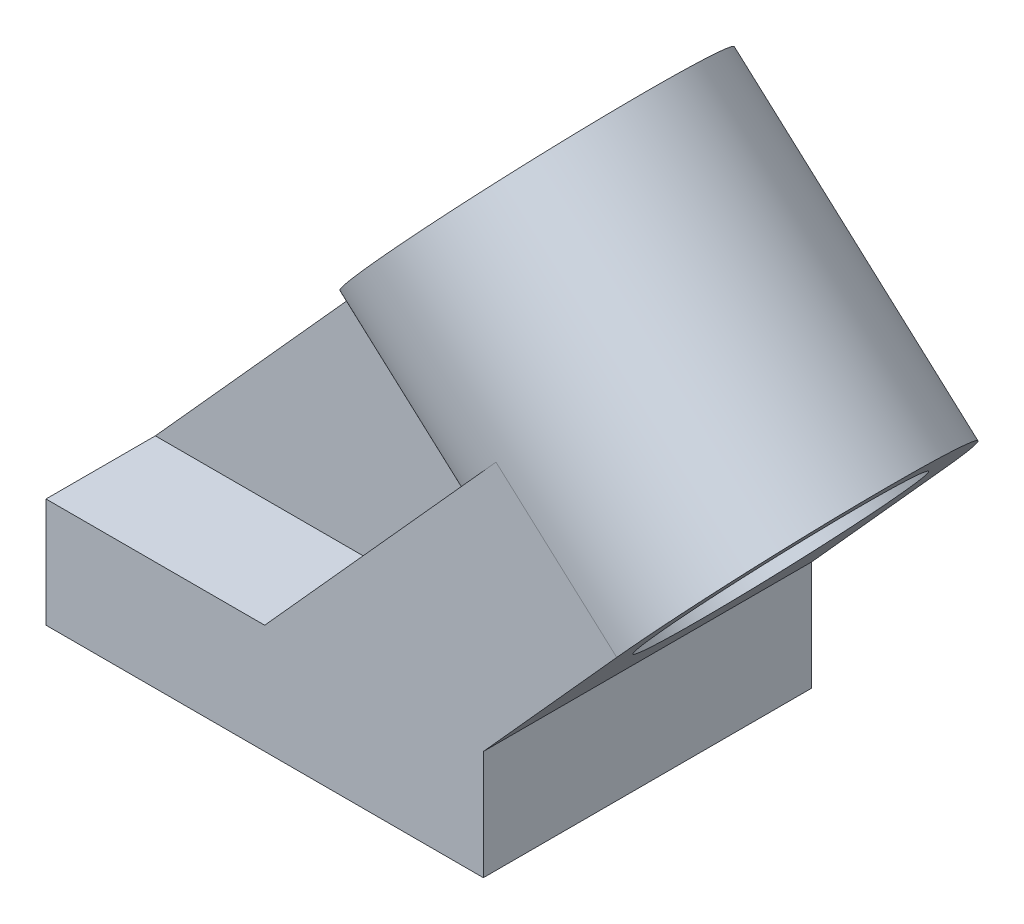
ISO-10303-21;
HEADER;
FILE_DESCRIPTION(('STEP AP214'),'2;1');
FILE_NAME('part.step','',(''),(''),'','','');
FILE_SCHEMA(('AUTOMOTIVE_DESIGN { 1 0 10303 214 1 1 1 1 }'));
ENDSEC;
DATA;
#1=APPLICATION_CONTEXT('core data for automotive mechanical design processes');
#2=APPLICATION_PROTOCOL_DEFINITION('international standard','automotive_design',2000,#1);
#3=PRODUCT_CONTEXT('',#1,'mechanical');
#4=PRODUCT('Part','Part','',(#3));
#5=PRODUCT_RELATED_PRODUCT_CATEGORY('part','',(#4));
#6=PRODUCT_DEFINITION_FORMATION('','',#4);
#7=PRODUCT_DEFINITION_CONTEXT('part definition',#1,'design');
#8=PRODUCT_DEFINITION('design','',#6,#7);
#9=PRODUCT_DEFINITION_SHAPE('','',#8);
#10=(LENGTH_UNIT() NAMED_UNIT(*) SI_UNIT(.MILLI.,.METRE.));
#11=(NAMED_UNIT(*) PLANE_ANGLE_UNIT() SI_UNIT($,.RADIAN.));
#12=(NAMED_UNIT(*) SI_UNIT($,.STERADIAN.) SOLID_ANGLE_UNIT());
#13=UNCERTAINTY_MEASURE_WITH_UNIT(LENGTH_MEASURE(1.E-05),#10,'distance_accuracy_value','');
#14=(GEOMETRIC_REPRESENTATION_CONTEXT(3) GLOBAL_UNCERTAINTY_ASSIGNED_CONTEXT((#13)) GLOBAL_UNIT_ASSIGNED_CONTEXT((#10,
#11,#12)) REPRESENTATION_CONTEXT('',''));
#15=CARTESIAN_POINT('',(0.,0.,0.));
#16=DIRECTION('',(0.,0.,1.));
#17=DIRECTION('',(1.,0.,0.));
#18=AXIS2_PLACEMENT_3D('',#15,#16,#17);
#19=CARTESIAN_POINT('',(104.536651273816,85.0805974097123,76.2));
#20=DIRECTION('',(0.743144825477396,-0.669130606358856,0.));
#21=DIRECTION('',(0.669130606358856,0.743144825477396,0.));
#22=AXIS2_PLACEMENT_3D('',#19,#20,#21);
#23=PLANE('',#22);
#24=DIRECTION('',(-0.669130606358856,-0.743144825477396,0.));
#25=VECTOR('',#24,1.);
#26=CARTESIAN_POINT('',(104.536651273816,85.0805974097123,25.4));
#27=LINE('',#26,#25);
#28=CARTESIAN_POINT('',(80.5007943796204,58.3860739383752,25.4));
#29=VERTEX_POINT('',#28);
#30=CARTESIAN_POINT('',(50.8,25.4,25.4));
#31=VERTEX_POINT('',#30);
#32=EDGE_CURVE('E213',#29,#31,#27,.T.);
#33=ORIENTED_EDGE('',*,*,#32,.F.);
#34=CARTESIAN_POINT('',(104.536651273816,85.0805974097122,38.1));
#35=DIRECTION('',(0.743144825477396,-0.669130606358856,0.));
#36=DIRECTION('',(0.669130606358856,0.743144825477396,0.));
#37=AXIS2_PLACEMENT_3D('',#34,#35,#36);
#38=CIRCLE('',#37,38.1);
#39=CARTESIAN_POINT('',(104.536651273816,85.0805974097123,0.));
#40=VERTEX_POINT('',#39);
#41=EDGE_CURVE('E136',#29,#40,#38,.T.);
#42=ORIENTED_EDGE('',*,*,#41,.T.);
#43=DIRECTION('',(-0.669130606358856,-0.743144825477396,0.));
#44=VECTOR('',#43,1.);
#45=CARTESIAN_POINT('',(104.536651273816,85.0805974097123,0.));
#46=LINE('',#45,#44);
#47=CARTESIAN_POINT('',(50.8,25.4,0.));
#48=VERTEX_POINT('',#47);
#49=EDGE_CURVE('E164',#40,#48,#46,.T.);
#50=ORIENTED_EDGE('',*,*,#49,.T.);
#51=DIRECTION('',(0.,0.,-1.));
#52=VECTOR('',#51,1.);
#53=CARTESIAN_POINT('',(50.8,25.4,76.2));
#54=LINE('',#53,#52);
#55=EDGE_CURVE('E171',#31,#48,#54,.T.);
#56=ORIENTED_EDGE('',*,*,#55,.F.);
#57=EDGE_LOOP('',(#33,#42,#50,#56));
#58=FACE_BOUND('',#57,.T.);
#59=ADVANCED_FACE('F37',(#58),#23,.F.);
#60=CARTESIAN_POINT('',(50.8,25.4,76.2));
#61=DIRECTION('',(0.,-1.,0.));
#62=DIRECTION('',(1.,0.,0.));
#63=AXIS2_PLACEMENT_3D('',#60,#61,#62);
#64=PLANE('',#63);
#65=DIRECTION('',(-1.,0.,0.));
#66=VECTOR('',#65,1.);
#67=CARTESIAN_POINT('',(50.8,25.4,25.4));
#68=LINE('',#67,#66);
#69=CARTESIAN_POINT('',(0.,25.4,25.4));
#70=VERTEX_POINT('',#69);
#71=EDGE_CURVE('E216',#31,#70,#68,.T.);
#72=ORIENTED_EDGE('',*,*,#71,.F.);
#73=ORIENTED_EDGE('',*,*,#55,.T.);
#74=DIRECTION('',(-1.,0.,0.));
#75=VECTOR('',#74,1.);
#76=CARTESIAN_POINT('',(50.8,25.4,0.));
#77=LINE('',#76,#75);
#78=CARTESIAN_POINT('',(0.,25.4,0.));
#79=VERTEX_POINT('',#78);
#80=EDGE_CURVE('E148',#48,#79,#77,.T.);
#81=ORIENTED_EDGE('',*,*,#80,.T.);
#82=DIRECTION('',(0.,0.,-1.));
#83=VECTOR('',#82,1.);
#84=CARTESIAN_POINT('',(0.,25.4,76.2));
#85=LINE('',#84,#83);
#86=EDGE_CURVE('E88',#70,#79,#85,.T.);
#87=ORIENTED_EDGE('',*,*,#86,.F.);
#88=EDGE_LOOP('',(#72,#73,#81,#87));
#89=FACE_BOUND('',#88,.T.);
#90=ADVANCED_FACE('F244',(#89),#64,.F.);
#91=CARTESIAN_POINT('',(0.,25.4,76.2));
#92=DIRECTION('',(1.,0.,0.));
#93=DIRECTION('',(0.,0.,-1.));
#94=AXIS2_PLACEMENT_3D('',#91,#92,#93);
#95=PLANE('',#94);
#96=CARTESIAN_POINT('',(0.,25.4,76.2));
#97=VERTEX_POINT('',#96);
#98=CARTESIAN_POINT('',(0.,25.4,50.8));
#99=VERTEX_POINT('',#98);
#100=EDGE_CURVE('E168',#97,#99,#85,.T.);
#101=ORIENTED_EDGE('',*,*,#100,.T.);
#102=DIRECTION('',(0.,0.,1.));
#103=VECTOR('',#102,1.);
#104=CARTESIAN_POINT('',(0.,25.4,76.2));
#105=LINE('',#104,#103);
#106=EDGE_CURVE('E198',#99,#70,#105,.F.);
#107=ORIENTED_EDGE('',*,*,#106,.T.);
#108=ORIENTED_EDGE('',*,*,#86,.T.);
#109=DIRECTION('',(0.,-1.,0.));
#110=VECTOR('',#109,1.);
#111=CARTESIAN_POINT('',(0.,25.4,0.));
#112=LINE('',#111,#110);
#113=CARTESIAN_POINT('',(0.,0.,0.));
#114=VERTEX_POINT('',#113);
#115=EDGE_CURVE('E135',#79,#114,#112,.T.);
#116=ORIENTED_EDGE('',*,*,#115,.T.);
#117=DIRECTION('',(0.,0.,-1.));
#118=VECTOR('',#117,1.);
#119=CARTESIAN_POINT('',(0.,0.,76.2));
#120=LINE('',#119,#118);
#121=CARTESIAN_POINT('',(0.,0.,76.2));
#122=VERTEX_POINT('',#121);
#123=EDGE_CURVE('E11',#122,#114,#120,.T.);
#124=ORIENTED_EDGE('',*,*,#123,.F.);
#125=DIRECTION('',(0.,-1.,0.));
#126=VECTOR('',#125,1.);
#127=CARTESIAN_POINT('',(0.,25.4,76.2));
#128=LINE('',#127,#126);
#129=EDGE_CURVE('E146',#97,#122,#128,.T.);
#130=ORIENTED_EDGE('',*,*,#129,.F.);
#131=EDGE_LOOP('',(#101,#107,#108,#116,#124,#130));
#132=FACE_BOUND('',#131,.T.);
#133=ADVANCED_FACE('F39',(#132),#95,.F.);
#134=CARTESIAN_POINT('',(0.,0.,76.2));
#135=DIRECTION('',(0.,1.,0.));
#136=DIRECTION('',(0.,0.,1.));
#137=AXIS2_PLACEMENT_3D('',#134,#135,#136);
#138=PLANE('',#137);
#139=ORIENTED_EDGE('',*,*,#123,.T.);
#140=DIRECTION('',(1.,0.,0.));
#141=VECTOR('',#140,1.);
#142=CARTESIAN_POINT('',(0.,0.,0.));
#143=LINE('',#142,#141);
#144=CARTESIAN_POINT('',(101.6,0.,0.));
#145=VERTEX_POINT('',#144);
#146=EDGE_CURVE('E138',#114,#145,#143,.T.);
#147=ORIENTED_EDGE('',*,*,#146,.T.);
#148=DIRECTION('',(0.,0.,-1.));
#149=VECTOR('',#148,1.);
#150=CARTESIAN_POINT('',(101.6,0.,76.2));
#151=LINE('',#150,#149);
#152=CARTESIAN_POINT('',(101.6,0.,76.2));
#153=VERTEX_POINT('',#152);
#154=EDGE_CURVE('E45',#153,#145,#151,.T.);
#155=ORIENTED_EDGE('',*,*,#154,.F.);
#156=DIRECTION('',(1.,0.,0.));
#157=VECTOR('',#156,1.);
#158=CARTESIAN_POINT('',(0.,0.,76.2));
#159=LINE('',#158,#157);
#160=EDGE_CURVE('E96',#122,#153,#159,.T.);
#161=ORIENTED_EDGE('',*,*,#160,.F.);
#162=EDGE_LOOP('',(#139,#147,#155,#161));
#163=FACE_BOUND('',#162,.T.);
#164=ADVANCED_FACE('F181',(#163),#138,.F.);
#165=CARTESIAN_POINT('',(101.6,0.,76.2));
#166=DIRECTION('',(-1.,0.,0.));
#167=DIRECTION('',(0.,0.,1.));
#168=AXIS2_PLACEMENT_3D('',#165,#166,#167);
#169=PLANE('',#168);
#170=ORIENTED_EDGE('',*,*,#154,.T.);
#171=DIRECTION('',(0.,1.,0.));
#172=VECTOR('',#171,1.);
#173=CARTESIAN_POINT('',(101.6,0.,0.));
#174=LINE('',#173,#172);
#175=CARTESIAN_POINT('',(101.6,25.4,0.));
#176=VERTEX_POINT('',#175);
#177=EDGE_CURVE('E156',#145,#176,#174,.T.);
#178=ORIENTED_EDGE('',*,*,#177,.T.);
#179=DIRECTION('',(0.,0.,-1.));
#180=VECTOR('',#179,1.);
#181=CARTESIAN_POINT('',(101.6,25.4,76.2));
#182=LINE('',#181,#180);
#183=CARTESIAN_POINT('',(101.6,25.4,76.2));
#184=VERTEX_POINT('',#183);
#185=EDGE_CURVE('E173',#184,#176,#182,.T.);
#186=ORIENTED_EDGE('',*,*,#185,.F.);
#187=DIRECTION('',(0.,1.,0.));
#188=VECTOR('',#187,1.);
#189=CARTESIAN_POINT('',(101.6,0.,76.2));
#190=LINE('',#189,#188);
#191=EDGE_CURVE('E150',#153,#184,#190,.T.);
#192=ORIENTED_EDGE('',*,*,#191,.F.);
#193=EDGE_LOOP('',(#170,#178,#186,#192));
#194=FACE_BOUND('',#193,.T.);
#195=ADVANCED_FACE('F176',(#194),#169,.F.);
#196=CARTESIAN_POINT('',(101.6,25.4,76.2));
#197=DIRECTION('',(-0.743144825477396,0.669130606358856,0.));
#198=DIRECTION('',(-0.669130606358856,-0.743144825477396,0.));
#199=AXIS2_PLACEMENT_3D('',#196,#197,#198);
#200=PLANE('',#199);
#201=CARTESIAN_POINT('',(132.591674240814,59.8197412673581,38.1));
#202=DIRECTION('',(-0.743144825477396,0.669130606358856,0.));
#203=DIRECTION('',(-0.669130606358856,-0.743144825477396,0.));
#204=AXIS2_PLACEMENT_3D('',#201,#202,#203);
#205=CIRCLE('',#204,28.575);
#206=CARTESIAN_POINT('',(113.47126716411,38.5843778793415,38.1));
#207=VERTEX_POINT('',#206);
#208=EDGE_CURVE('E190',#207,#207,#205,.T.);
#209=ORIENTED_EDGE('',*,*,#208,.T.);
#210=EDGE_LOOP('',(#209));
#211=FACE_BOUND('',#210,.T.);
#212=ORIENTED_EDGE('',*,*,#185,.T.);
#213=DIRECTION('',(0.669130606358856,0.743144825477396,0.));
#214=VECTOR('',#213,1.);
#215=CARTESIAN_POINT('',(101.6,25.4,0.));
#216=LINE('',#215,#214);
#217=CARTESIAN_POINT('',(132.591674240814,59.8197412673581,0.));
#218=VERTEX_POINT('',#217);
#219=EDGE_CURVE('E159',#176,#218,#216,.T.);
#220=ORIENTED_EDGE('',*,*,#219,.T.);
#221=CARTESIAN_POINT('',(132.591674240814,59.8197412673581,38.1));
#222=DIRECTION('',(0.743144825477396,-0.669130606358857,0.));
#223=DIRECTION('',(0.669130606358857,0.743144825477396,0.));
#224=AXIS2_PLACEMENT_3D('',#221,#222,#223);
#225=CIRCLE('',#224,38.1);
#226=CARTESIAN_POINT('',(132.591674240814,59.8197412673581,76.2));
#227=VERTEX_POINT('',#226);
#228=EDGE_CURVE('E144',#218,#227,#225,.T.);
#229=ORIENTED_EDGE('',*,*,#228,.T.);
#230=DIRECTION('',(0.669130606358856,0.743144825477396,0.));
#231=VECTOR('',#230,1.);
#232=CARTESIAN_POINT('',(101.6,25.4,76.2));
#233=LINE('',#232,#231);
#234=EDGE_CURVE('E115',#184,#227,#233,.T.);
#235=ORIENTED_EDGE('',*,*,#234,.F.);
#236=EDGE_LOOP('',(#212,#220,#229,#235));
#237=FACE_BOUND('',#236,.T.);
#238=ADVANCED_FACE('F189',(#211,#237),#200,.F.);
#239=CARTESIAN_POINT('',(104.536651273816,85.0805974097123,76.2));
#240=VERTEX_POINT('',#239);
#241=CARTESIAN_POINT('',(80.5007943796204,58.3860739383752,50.8));
#242=VERTEX_POINT('',#241);
#243=EDGE_CURVE('E125',#240,#242,#38,.T.);
#244=ORIENTED_EDGE('',*,*,#243,.T.);
#245=DIRECTION('',(-0.669130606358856,-0.743144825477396,0.));
#246=VECTOR('',#245,1.);
#247=CARTESIAN_POINT('',(104.536651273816,85.0805974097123,50.8));
#248=LINE('',#247,#246);
#249=CARTESIAN_POINT('',(50.8,25.4,50.8));
#250=VERTEX_POINT('',#249);
#251=EDGE_CURVE('E205',#242,#250,#248,.T.);
#252=ORIENTED_EDGE('',*,*,#251,.T.);
#253=CARTESIAN_POINT('',(50.8,25.4,76.2));
#254=VERTEX_POINT('',#253);
#255=EDGE_CURVE('E127',#254,#250,#54,.T.);
#256=ORIENTED_EDGE('',*,*,#255,.F.);
#257=DIRECTION('',(-0.669130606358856,-0.743144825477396,0.));
#258=VECTOR('',#257,1.);
#259=CARTESIAN_POINT('',(104.536651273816,85.0805974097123,76.2));
#260=LINE('',#259,#258);
#261=EDGE_CURVE('E112',#240,#254,#260,.T.);
#262=ORIENTED_EDGE('',*,*,#261,.F.);
#263=EDGE_LOOP('',(#244,#252,#256,#262));
#264=FACE_BOUND('',#263,.T.);
#265=ADVANCED_FACE('F122',(#264),#23,.F.);
#266=ORIENTED_EDGE('',*,*,#255,.T.);
#267=DIRECTION('',(-1.,0.,0.));
#268=VECTOR('',#267,1.);
#269=CARTESIAN_POINT('',(50.8,25.4,50.8));
#270=LINE('',#269,#268);
#271=EDGE_CURVE('E207',#250,#99,#270,.T.);
#272=ORIENTED_EDGE('',*,*,#271,.T.);
#273=ORIENTED_EDGE('',*,*,#100,.F.);
#274=DIRECTION('',(-1.,0.,0.));
#275=VECTOR('',#274,1.);
#276=CARTESIAN_POINT('',(50.8,25.4,76.2));
#277=LINE('',#276,#275);
#278=EDGE_CURVE('E61',#254,#97,#277,.T.);
#279=ORIENTED_EDGE('',*,*,#278,.F.);
#280=EDGE_LOOP('',(#266,#272,#273,#279));
#281=FACE_BOUND('',#280,.T.);
#282=ADVANCED_FACE('F251',(#281),#64,.F.);
#283=CARTESIAN_POINT('',(0.,0.,76.2));
#284=DIRECTION('',(0.,0.,1.));
#285=DIRECTION('',(1.,0.,0.));
#286=AXIS2_PLACEMENT_3D('',#283,#284,#285);
#287=PLANE('',#286);
#288=ORIENTED_EDGE('',*,*,#129,.T.);
#289=ORIENTED_EDGE('',*,*,#160,.T.);
#290=ORIENTED_EDGE('',*,*,#191,.T.);
#291=ORIENTED_EDGE('',*,*,#234,.T.);
#292=DIRECTION('',(-0.743144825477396,0.669130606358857,0.));
#293=VECTOR('',#292,1.);
#294=CARTESIAN_POINT('',(132.591674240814,59.8197412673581,76.2));
#295=LINE('',#294,#293);
#296=EDGE_CURVE('E109',#227,#240,#295,.T.);
#297=ORIENTED_EDGE('',*,*,#296,.T.);
#298=ORIENTED_EDGE('',*,*,#261,.T.);
#299=ORIENTED_EDGE('',*,*,#278,.T.);
#300=EDGE_LOOP('',(#288,#289,#290,#291,#297,#298,#299));
#301=FACE_BOUND('',#300,.T.);
#302=ADVANCED_FACE('F111',(#301),#287,.T.);
#303=CARTESIAN_POINT('',(0.,0.,0.));
#304=DIRECTION('',(0.,0.,1.));
#305=DIRECTION('',(1.,0.,0.));
#306=AXIS2_PLACEMENT_3D('',#303,#304,#305);
#307=PLANE('',#306);
#308=ORIENTED_EDGE('',*,*,#115,.F.);
#309=ORIENTED_EDGE('',*,*,#80,.F.);
#310=ORIENTED_EDGE('',*,*,#49,.F.);
#311=DIRECTION('',(-0.743144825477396,0.669130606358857,0.));
#312=VECTOR('',#311,1.);
#313=CARTESIAN_POINT('',(132.591674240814,59.8197412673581,0.));
#314=LINE('',#313,#312);
#315=EDGE_CURVE('E161',#218,#40,#314,.T.);
#316=ORIENTED_EDGE('',*,*,#315,.F.);
#317=ORIENTED_EDGE('',*,*,#219,.F.);
#318=ORIENTED_EDGE('',*,*,#177,.F.);
#319=ORIENTED_EDGE('',*,*,#146,.F.);
#320=EDGE_LOOP('',(#308,#309,#310,#316,#317,#318,#319));
#321=FACE_BOUND('',#320,.T.);
#322=ADVANCED_FACE('F185',(#321),#307,.F.);
#323=CARTESIAN_POINT('',(75.9640385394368,110.807493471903,38.1));
#324=DIRECTION('',(0.743144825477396,-0.669130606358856,0.));
#325=DIRECTION('',(0.669130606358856,0.743144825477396,0.));
#326=AXIS2_PLACEMENT_3D('',#323,#324,#325);
#327=CYLINDRICAL_SURFACE('',#326,38.1);
#328=ORIENTED_EDGE('',*,*,#296,.F.);
#329=ORIENTED_EDGE('',*,*,#228,.F.);
#330=ORIENTED_EDGE('',*,*,#315,.T.);
#331=ORIENTED_EDGE('',*,*,#41,.F.);
#332=DIRECTION('',(0.743144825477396,-0.669130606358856,0.));
#333=VECTOR('',#332,1.);
#334=CARTESIAN_POINT('',(51.9281816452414,84.1129700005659,25.4));
#335=LINE('',#334,#333);
#336=CARTESIAN_POINT('',(52.4457714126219,83.6469300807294,25.4));
#337=VERTEX_POINT('',#336);
#338=EDGE_CURVE('E210',#29,#337,#335,.F.);
#339=ORIENTED_EDGE('',*,*,#338,.T.);
#340=CARTESIAN_POINT('',(76.4816283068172,110.341453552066,38.1));
#341=DIRECTION('',(0.743144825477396,-0.669130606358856,0.));
#342=DIRECTION('',(0.669130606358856,0.743144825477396,0.));
#343=AXIS2_PLACEMENT_3D('',#340,#341,#342);
#344=CIRCLE('',#343,38.1);
#345=CARTESIAN_POINT('',(52.4457714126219,83.6469300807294,50.8));
#346=VERTEX_POINT('',#345);
#347=EDGE_CURVE('E202',#346,#337,#344,.T.);
#348=ORIENTED_EDGE('',*,*,#347,.F.);
#349=DIRECTION('',(0.743144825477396,-0.669130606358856,0.));
#350=VECTOR('',#349,1.);
#351=CARTESIAN_POINT('',(51.9281816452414,84.1129700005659,50.8));
#352=LINE('',#351,#350);
#353=EDGE_CURVE('E134',#242,#346,#352,.F.);
#354=ORIENTED_EDGE('',*,*,#353,.F.);
#355=ORIENTED_EDGE('',*,*,#243,.F.);
#356=EDGE_LOOP('',(#328,#329,#330,#331,#339,#348,#354,#355));
#357=FACE_BOUND('',#356,.T.);
#358=CARTESIAN_POINT('',(75.9640385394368,110.807493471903,38.1));
#359=DIRECTION('',(0.743144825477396,-0.669130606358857,0.));
#360=DIRECTION('',(0.669130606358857,0.743144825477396,0.));
#361=AXIS2_PLACEMENT_3D('',#358,#359,#360);
#362=CIRCLE('',#361,38.1);
#363=CARTESIAN_POINT('',(101.457914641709,139.121311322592,38.1));
#364=VERTEX_POINT('',#363);
#365=EDGE_CURVE('E141',#364,#364,#362,.T.);
#366=ORIENTED_EDGE('',*,*,#365,.T.);
#367=EDGE_LOOP('',(#366));
#368=FACE_BOUND('',#367,.T.);
#369=ADVANCED_FACE('F130',(#357,#368),#327,.T.);
#370=CARTESIAN_POINT('',(75.9640385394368,110.807493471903,38.1));
#371=DIRECTION('',(0.743144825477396,-0.669130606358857,0.));
#372=DIRECTION('',(0.669130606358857,0.743144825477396,0.));
#373=AXIS2_PLACEMENT_3D('',#370,#371,#372);
#374=PLANE('',#373);
#375=CARTESIAN_POINT('',(75.9640385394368,110.807493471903,38.1));
#376=DIRECTION('',(-0.743144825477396,0.669130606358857,0.));
#377=DIRECTION('',(-0.669130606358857,-0.743144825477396,0.));
#378=AXIS2_PLACEMENT_3D('',#375,#376,#377);
#379=CIRCLE('',#378,28.575);
#380=CARTESIAN_POINT('',(56.8436314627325,89.5721300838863,38.1));
#381=VERTEX_POINT('',#380);
#382=EDGE_CURVE('E193',#381,#381,#379,.T.);
#383=ORIENTED_EDGE('',*,*,#382,.F.);
#384=EDGE_LOOP('',(#383));
#385=FACE_BOUND('',#384,.T.);
#386=ORIENTED_EDGE('',*,*,#365,.F.);
#387=EDGE_LOOP('',(#386));
#388=FACE_BOUND('',#387,.T.);
#389=ADVANCED_FACE('F300',(#385,#388),#374,.F.);
#390=CARTESIAN_POINT('',(176.41705137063,20.359194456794,38.1));
#391=DIRECTION('',(-0.743144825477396,0.669130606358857,0.));
#392=DIRECTION('',(-0.669130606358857,-0.743144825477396,0.));
#393=AXIS2_PLACEMENT_3D('',#390,#391,#392);
#394=CYLINDRICAL_SURFACE('',#393,28.575);
#395=ORIENTED_EDGE('',*,*,#208,.F.);
#396=EDGE_LOOP('',(#395));
#397=FACE_BOUND('',#396,.T.);
#398=ORIENTED_EDGE('',*,*,#382,.T.);
#399=EDGE_LOOP('',(#398));
#400=FACE_BOUND('',#399,.T.);
#401=ADVANCED_FACE('F305',(#397,#400),#394,.F.);
#402=CARTESIAN_POINT('',(0.,25.4,38.1));
#403=DIRECTION('',(0.743144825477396,-0.669130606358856,0.));
#404=DIRECTION('',(0.669130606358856,0.743144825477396,0.));
#405=AXIS2_PLACEMENT_3D('',#402,#403,#404);
#406=PLANE('',#405);
#407=ORIENTED_EDGE('',*,*,#106,.F.);
#408=DIRECTION('',(0.669130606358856,0.743144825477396,0.));
#409=VECTOR('',#408,1.);
#410=CARTESIAN_POINT('',(0.,25.4,50.8));
#411=LINE('',#410,#409);
#412=EDGE_CURVE('E218',#99,#346,#411,.T.);
#413=ORIENTED_EDGE('',*,*,#412,.T.);
#414=ORIENTED_EDGE('',*,*,#347,.T.);
#415=DIRECTION('',(0.669130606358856,0.743144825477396,0.));
#416=VECTOR('',#415,1.);
#417=CARTESIAN_POINT('',(0.,25.4,25.4));
#418=LINE('',#417,#416);
#419=EDGE_CURVE('E52',#70,#337,#418,.T.);
#420=ORIENTED_EDGE('',*,*,#419,.F.);
#421=EDGE_LOOP('',(#407,#413,#414,#420));
#422=FACE_BOUND('',#421,.T.);
#423=ADVANCED_FACE('F225',(#422),#406,.F.);
#424=CARTESIAN_POINT('',(79.0427751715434,69.5606556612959,50.8));
#425=DIRECTION('',(0.,0.,1.));
#426=DIRECTION('',(1.,0.,0.));
#427=AXIS2_PLACEMENT_3D('',#424,#425,#426);
#428=PLANE('',#427);
#429=ORIENTED_EDGE('',*,*,#251,.F.);
#430=ORIENTED_EDGE('',*,*,#353,.T.);
#431=ORIENTED_EDGE('',*,*,#412,.F.);
#432=ORIENTED_EDGE('',*,*,#271,.F.);
#433=EDGE_LOOP('',(#429,#430,#431,#432));
#434=FACE_BOUND('',#433,.T.);
#435=ADVANCED_FACE('F249',(#434),#428,.T.);
#436=CARTESIAN_POINT('',(79.0427751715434,69.5606556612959,25.4));
#437=DIRECTION('',(0.,0.,1.));
#438=DIRECTION('',(1.,0.,0.));
#439=AXIS2_PLACEMENT_3D('',#436,#437,#438);
#440=PLANE('',#439);
#441=ORIENTED_EDGE('',*,*,#338,.F.);
#442=ORIENTED_EDGE('',*,*,#32,.T.);
#443=ORIENTED_EDGE('',*,*,#71,.T.);
#444=ORIENTED_EDGE('',*,*,#419,.T.);
#445=EDGE_LOOP('',(#441,#442,#443,#444));
#446=FACE_BOUND('',#445,.T.);
#447=ADVANCED_FACE('F234',(#446),#440,.F.);
#448=CLOSED_SHELL('',(#59,#90,#133,#164,#195,#238,#265,#282,#302,#322,#369,#389,#401,#423,#435,#447));
#449=MANIFOLD_SOLID_BREP('B2',#448);
#450=ADVANCED_BREP_SHAPE_REPRESENTATION('',(#18,#449),#14);
#451=SHAPE_DEFINITION_REPRESENTATION(#9,#450);
ENDSEC;
END-ISO-10303-21;
